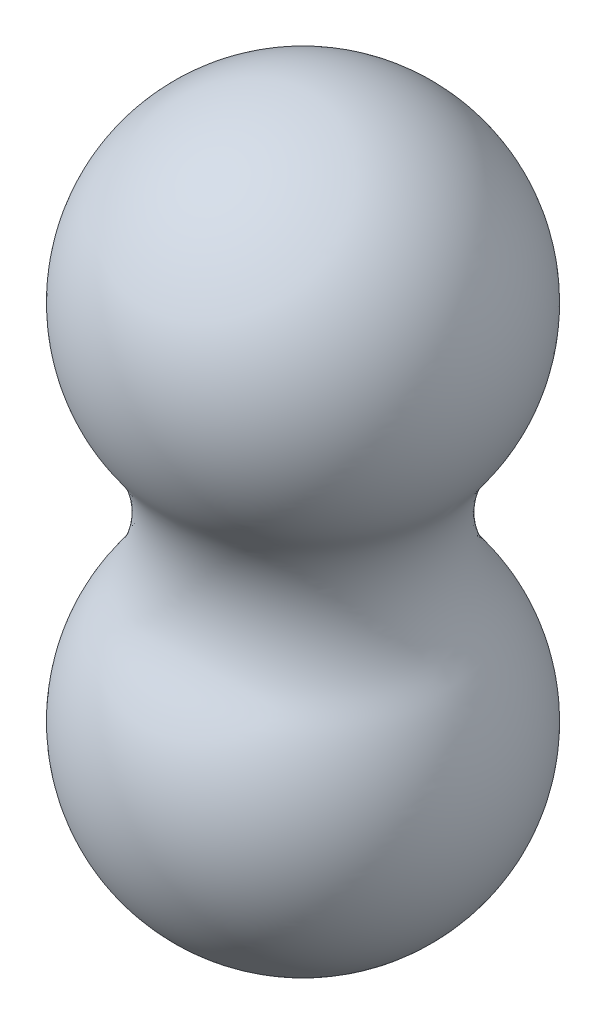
ISO-10303-21;
HEADER;
FILE_DESCRIPTION(('STEP AP214'),'2;1');
FILE_NAME('part.step','',(''),(''),'','','');
FILE_SCHEMA(('AUTOMOTIVE_DESIGN { 1 0 10303 214 1 1 1 1 }'));
ENDSEC;
DATA;
#1=APPLICATION_CONTEXT('core data for automotive mechanical design processes');
#2=APPLICATION_PROTOCOL_DEFINITION('international standard','automotive_design',2000,#1);
#3=PRODUCT_CONTEXT('',#1,'mechanical');
#4=PRODUCT('Part','Part','',(#3));
#5=PRODUCT_RELATED_PRODUCT_CATEGORY('part','',(#4));
#6=PRODUCT_DEFINITION_FORMATION('','',#4);
#7=PRODUCT_DEFINITION_CONTEXT('part definition',#1,'design');
#8=PRODUCT_DEFINITION('design','',#6,#7);
#9=PRODUCT_DEFINITION_SHAPE('','',#8);
#10=(LENGTH_UNIT() NAMED_UNIT(*) SI_UNIT(.MILLI.,.METRE.));
#11=(NAMED_UNIT(*) PLANE_ANGLE_UNIT() SI_UNIT($,.RADIAN.));
#12=(NAMED_UNIT(*) SI_UNIT($,.STERADIAN.) SOLID_ANGLE_UNIT());
#13=UNCERTAINTY_MEASURE_WITH_UNIT(LENGTH_MEASURE(1.E-05),#10,'distance_accuracy_value','');
#14=(GEOMETRIC_REPRESENTATION_CONTEXT(3) GLOBAL_UNCERTAINTY_ASSIGNED_CONTEXT((#13)) GLOBAL_UNIT_ASSIGNED_CONTEXT((#10,
#11,#12)) REPRESENTATION_CONTEXT('',''));
#15=CARTESIAN_POINT('',(0.,0.,0.));
#16=DIRECTION('',(0.,0.,1.));
#17=DIRECTION('',(1.,0.,0.));
#18=AXIS2_PLACEMENT_3D('',#15,#16,#17);
#19=CARTESIAN_POINT('',(0.,0.,0.));
#20=CARTESIAN_POINT('',(12.115212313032,0.,0.));
#21=CARTESIAN_POINT('',(18.6714362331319,10.1879486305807,0.));
#22=CARTESIAN_POINT('',(13.652108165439,21.2144945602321,0.));
#23=CARTESIAN_POINT('',(13.3556536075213,21.8657510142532,0.));
#24=CARTESIAN_POINT('',(12.669542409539,23.1258379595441,0.));
#25=CARTESIAN_POINT('',(11.3377264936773,24.8497889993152,0.));
#26=CARTESIAN_POINT('',(10.7394456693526,26.1588863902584,0.));
#27=CARTESIAN_POINT('',(10.5131670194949,26.8377223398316,0.));
#28=CARTESIAN_POINT('',(9.82288502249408,28.908568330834,0.));
#29=CARTESIAN_POINT('',(9.82288502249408,31.091431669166,0.));
#30=CARTESIAN_POINT('',(10.5131670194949,33.1622776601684,0.));
#31=CARTESIAN_POINT('',(10.7394456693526,33.8411136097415,0.));
#32=CARTESIAN_POINT('',(11.3377264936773,35.1502110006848,0.));
#33=CARTESIAN_POINT('',(12.669542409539,36.8741620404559,0.));
#34=CARTESIAN_POINT('',(13.3556536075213,38.1342489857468,0.));
#35=CARTESIAN_POINT('',(13.652108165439,38.7855054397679,0.));
#36=CARTESIAN_POINT('',(18.6714362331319,49.8120513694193,0.));
#37=CARTESIAN_POINT('',(12.115212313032,60.,0.));
#38=CARTESIAN_POINT('',(0.,60.,0.));
#39=(BOUNDED_CURVE() B_SPLINE_CURVE(3,(#19,#20,#21,#22,#23,#24,#25,#26,#27,#28,#29,#30,#31,#32,
#33,#34,#35,#36,#37,#38),.UNSPECIFIED.,.F.,.F.) B_SPLINE_CURVE_WITH_KNOTS((4,3,1,1,3,3,1,1,3,4),
(0.,0.362154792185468,0.392971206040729,0.42378761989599,0.454604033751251,0.545395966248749,
0.57621238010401,0.607028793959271,0.637845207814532,1.),
.UNSPECIFIED.) CURVE() GEOMETRIC_REPRESENTATION_ITEM() RATIONAL_B_SPLINE_CURVE((1.,
0.694104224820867,0.694104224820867,1.,1.,1.,1.,1.,1.,0.965788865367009,0.965788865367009,1.,1.,
1.,1.,1.,1.,0.694104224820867,0.694104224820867,1.)) REPRESENTATION_ITEM(''));
#40=CARTESIAN_POINT('',(0.,0.,0.));
#41=DIRECTION('',(0.,-1.,0.));
#42=AXIS1_PLACEMENT('',#40,#41);
#43=SURFACE_OF_REVOLUTION('',#39,#42);
#44=CARTESIAN_POINT('',(0.,60.,0.));
#45=VERTEX_POINT('',#44);
#46=VERTEX_LOOP('',#45);
#47=FACE_BOUND('',#46,.T.);
#48=CARTESIAN_POINT('',(0.,0.,0.));
#49=VERTEX_POINT('',#48);
#50=VERTEX_LOOP('',#49);
#51=FACE_BOUND('',#50,.T.);
#52=ADVANCED_FACE('F32',(#47,#51),#43,.F.);
#53=CLOSED_SHELL('',(#52));
#54=MANIFOLD_SOLID_BREP('B2',#53);
#55=ADVANCED_BREP_SHAPE_REPRESENTATION('',(#18,#54),#14);
#56=SHAPE_DEFINITION_REPRESENTATION(#9,#55);
ENDSEC;
END-ISO-10303-21;
